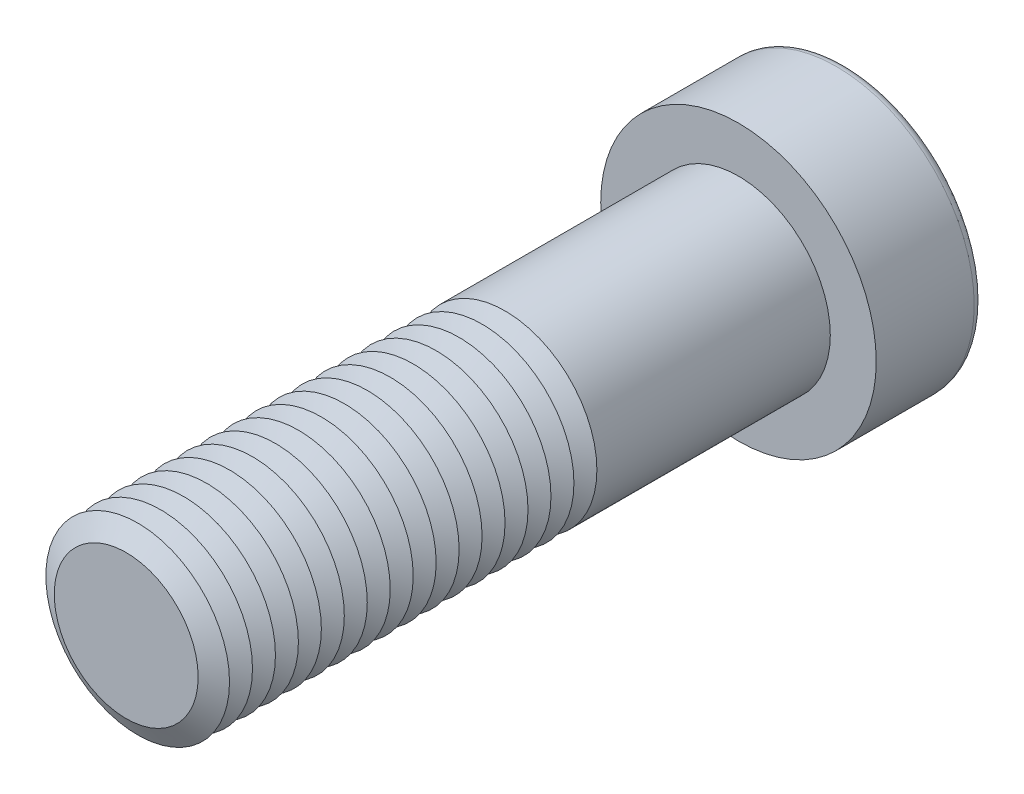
from build123d import *

# Parameters (mm, degrees)
SKETCH1_R           = 12
BOSS_EXTRUDE1_DEPTH = 80
SKETCH2_R           = 18
BOSS_EXTRUDE2_DEPTH = 14
CUT_EXTRUDE1_DEPTH  = 14.25
FILLET1_R           = 1.2
LPATTERN1_COUNT     = 17
LPATTERN1_PITCH     = 3


with BuildPart() as part:
    # Sketch1 → Boss-Extrude1 (new body)
    with BuildSketch(Plane.XY):
        Circle(SKETCH1_R)
    extrude(amount=BOSS_EXTRUDE1_DEPTH)

    # Sketch2 → Boss-Extrude2 (add)
    with BuildSketch(Plane(origin=(0, 0, 0), x_dir=(-1, 0, 0), z_dir=(0, 0, -1))):
        Circle(SKETCH2_R)
    extrude(amount=BOSS_EXTRUDE2_DEPTH)

    # Sketch3 → Cut-Extrude1 (cut)
    with BuildSketch(Plane(origin=(0, 0, -14), x_dir=(-1, 0, 0), z_dir=(0, 0, -1))):
        Polygon((-5.484827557, 9.5), (-10.969655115, 0), (-5.484827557, -9.5), (5.484827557, -9.5), (10.969655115, 0), (5.484827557, 9.5), align=None)
    extrude(amount=-CUT_EXTRUDE1_DEPTH, mode=Mode.SUBTRACT)

    # Fillet1
    fillet1_edges = [part.edges().sort_by_distance(p)[0] for p in [
        (18, 0, -14),
    ]]
    fillet(fillet1_edges, radius=FILLET1_R)

    # Cut-Extrude2 cone 1 section (on through the dimple's axis) → Cut-Extrude2 (revolve, cut)
    with BuildSketch(Plane(origin=(0, 0, 0.25), x_dir=(0, 1, 0), z_dir=(1, 0, 0))):
        Polygon((0, 0), (9.5, 0), (0, 5.484827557), align=None)
    revolve(axis=Axis((0, 0, 0.25), (0, 0, 1)), mode=Mode.SUBTRACT)

    # Cut-Extrude3 cone 1 section (on through the dimple's axis) → Cut-Extrude3 (revolve, cut)
    with BuildSketch(Plane(origin=(0, 0, -14), x_dir=(0, 1, 0), z_dir=(1, 0, 0))):
        Polygon((0, 0), (10.969655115, 0), (0, 2.939310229), align=None)
    revolve(axis=Axis((0, 0, -14), (0, 0, 1)), mode=Mode.SUBTRACT)

    # Sketch7 → Cut-Revolve1 (revolve, cut)
    with BuildSketch(Plane(origin=(0, 0, 0), x_dir=(0, 0, -1), z_dir=(1, 0, 0)), mode=Mode.PRIVATE) as cut_revolve1_sk:
        Polygon((-80, 9.401923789), (-78.5, 12), (-81.5, 12), align=None)
    cut_revolve1 = revolve(cut_revolve1_sk.sketch.rotate(Axis((0, 0, 80), (0, 0, -1)), 90), axis=Axis((0, 0, 80), (0, 0, -1)), mode=Mode.SUBTRACT)

    # LPattern1: Cut-Revolve1 ×17
    with Locations(*[(0, 0, -i * LPATTERN1_PITCH) for i in range(1, LPATTERN1_COUNT)]):
        add(cut_revolve1, mode=Mode.SUBTRACT)


solid = part.part
